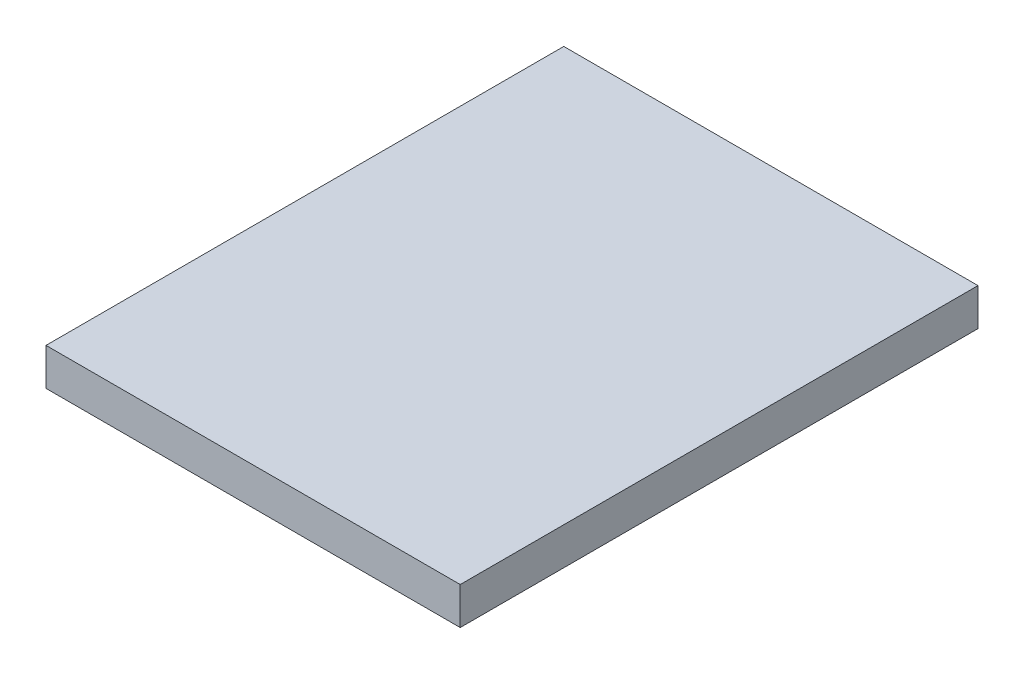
ISO-10303-21;
HEADER;
FILE_DESCRIPTION(('STEP AP214'),'2;1');
FILE_NAME('part.step','',(''),(''),'','','');
FILE_SCHEMA(('AUTOMOTIVE_DESIGN { 1 0 10303 214 1 1 1 1 }'));
ENDSEC;
DATA;
#1=APPLICATION_CONTEXT('core data for automotive mechanical design processes');
#2=APPLICATION_PROTOCOL_DEFINITION('international standard','automotive_design',2000,#1);
#3=PRODUCT_CONTEXT('',#1,'mechanical');
#4=PRODUCT('Part','Part','',(#3));
#5=PRODUCT_RELATED_PRODUCT_CATEGORY('part','',(#4));
#6=PRODUCT_DEFINITION_FORMATION('','',#4);
#7=PRODUCT_DEFINITION_CONTEXT('part definition',#1,'design');
#8=PRODUCT_DEFINITION('design','',#6,#7);
#9=PRODUCT_DEFINITION_SHAPE('','',#8);
#10=(LENGTH_UNIT() NAMED_UNIT(*) SI_UNIT(.MILLI.,.METRE.));
#11=(NAMED_UNIT(*) PLANE_ANGLE_UNIT() SI_UNIT($,.RADIAN.));
#12=(NAMED_UNIT(*) SI_UNIT($,.STERADIAN.) SOLID_ANGLE_UNIT());
#13=UNCERTAINTY_MEASURE_WITH_UNIT(LENGTH_MEASURE(1.E-05),#10,'distance_accuracy_value','');
#14=(GEOMETRIC_REPRESENTATION_CONTEXT(3) GLOBAL_UNCERTAINTY_ASSIGNED_CONTEXT((#13)) GLOBAL_UNIT_ASSIGNED_CONTEXT((#10,
#11,#12)) REPRESENTATION_CONTEXT('',''));
#15=CARTESIAN_POINT('',(0.,0.,0.));
#16=DIRECTION('',(0.,0.,1.));
#17=DIRECTION('',(1.,0.,0.));
#18=AXIS2_PLACEMENT_3D('',#15,#16,#17);
#19=CARTESIAN_POINT('',(100.,18.,125.));
#20=DIRECTION('',(-1.,0.,0.));
#21=DIRECTION('',(0.,0.,1.));
#22=AXIS2_PLACEMENT_3D('',#19,#20,#21);
#23=PLANE('',#22);
#24=DIRECTION('',(0.,0.,-1.));
#25=VECTOR('',#24,1.);
#26=CARTESIAN_POINT('',(100.,0.,125.));
#27=LINE('',#26,#25);
#28=CARTESIAN_POINT('',(100.,0.,125.));
#29=VERTEX_POINT('',#28);
#30=CARTESIAN_POINT('',(100.,0.,-125.));
#31=VERTEX_POINT('',#30);
#32=EDGE_CURVE('E102',#29,#31,#27,.T.);
#33=ORIENTED_EDGE('',*,*,#32,.T.);
#34=DIRECTION('',(0.,-1.,0.));
#35=VECTOR('',#34,1.);
#36=CARTESIAN_POINT('',(100.,18.,-125.));
#37=LINE('',#36,#35);
#38=CARTESIAN_POINT('',(100.,18.,-125.));
#39=VERTEX_POINT('',#38);
#40=EDGE_CURVE('E11',#39,#31,#37,.T.);
#41=ORIENTED_EDGE('',*,*,#40,.F.);
#42=DIRECTION('',(0.,0.,-1.));
#43=VECTOR('',#42,1.);
#44=CARTESIAN_POINT('',(100.,18.,125.));
#45=LINE('',#44,#43);
#46=CARTESIAN_POINT('',(100.,18.,125.));
#47=VERTEX_POINT('',#46);
#48=EDGE_CURVE('E90',#47,#39,#45,.T.);
#49=ORIENTED_EDGE('',*,*,#48,.F.);
#50=DIRECTION('',(0.,-1.,0.));
#51=VECTOR('',#50,1.);
#52=CARTESIAN_POINT('',(100.,18.,125.));
#53=LINE('',#52,#51);
#54=EDGE_CURVE('E98',#47,#29,#53,.T.);
#55=ORIENTED_EDGE('',*,*,#54,.T.);
#56=EDGE_LOOP('',(#33,#41,#49,#55));
#57=FACE_BOUND('',#56,.T.);
#58=ADVANCED_FACE('F39',(#57),#23,.F.);
#59=CARTESIAN_POINT('',(-100.,18.,-125.));
#60=DIRECTION('',(0.,0.,1.));
#61=DIRECTION('',(1.,0.,0.));
#62=AXIS2_PLACEMENT_3D('',#59,#60,#61);
#63=PLANE('',#62);
#64=DIRECTION('',(-1.,0.,0.));
#65=VECTOR('',#64,1.);
#66=CARTESIAN_POINT('',(-100.,0.,-125.));
#67=LINE('',#66,#65);
#68=CARTESIAN_POINT('',(-100.,0.,-125.));
#69=VERTEX_POINT('',#68);
#70=EDGE_CURVE('E94',#31,#69,#67,.T.);
#71=ORIENTED_EDGE('',*,*,#70,.T.);
#72=DIRECTION('',(0.,-1.,0.));
#73=VECTOR('',#72,1.);
#74=CARTESIAN_POINT('',(-100.,18.,-125.));
#75=LINE('',#74,#73);
#76=CARTESIAN_POINT('',(-100.,18.,-125.));
#77=VERTEX_POINT('',#76);
#78=EDGE_CURVE('E47',#77,#69,#75,.T.);
#79=ORIENTED_EDGE('',*,*,#78,.F.);
#80=DIRECTION('',(-1.,0.,0.));
#81=VECTOR('',#80,1.);
#82=CARTESIAN_POINT('',(-100.,18.,-125.));
#83=LINE('',#82,#81);
#84=EDGE_CURVE('E85',#39,#77,#83,.T.);
#85=ORIENTED_EDGE('',*,*,#84,.F.);
#86=ORIENTED_EDGE('',*,*,#40,.T.);
#87=EDGE_LOOP('',(#71,#79,#85,#86));
#88=FACE_BOUND('',#87,.T.);
#89=ADVANCED_FACE('F93',(#88),#63,.F.);
#90=CARTESIAN_POINT('',(-100.,18.,125.));
#91=DIRECTION('',(1.,0.,0.));
#92=DIRECTION('',(0.,0.,-1.));
#93=AXIS2_PLACEMENT_3D('',#90,#91,#92);
#94=PLANE('',#93);
#95=DIRECTION('',(0.,0.,1.));
#96=VECTOR('',#95,1.);
#97=CARTESIAN_POINT('',(-100.,0.,125.));
#98=LINE('',#97,#96);
#99=CARTESIAN_POINT('',(-100.,0.,125.));
#100=VERTEX_POINT('',#99);
#101=EDGE_CURVE('E72',#69,#100,#98,.T.);
#102=ORIENTED_EDGE('',*,*,#101,.T.);
#103=DIRECTION('',(0.,-1.,0.));
#104=VECTOR('',#103,1.);
#105=CARTESIAN_POINT('',(-100.,18.,125.));
#106=LINE('',#105,#104);
#107=CARTESIAN_POINT('',(-100.,18.,125.));
#108=VERTEX_POINT('',#107);
#109=EDGE_CURVE('E95',#108,#100,#106,.T.);
#110=ORIENTED_EDGE('',*,*,#109,.F.);
#111=DIRECTION('',(0.,0.,1.));
#112=VECTOR('',#111,1.);
#113=CARTESIAN_POINT('',(-100.,18.,125.));
#114=LINE('',#113,#112);
#115=EDGE_CURVE('E88',#77,#108,#114,.T.);
#116=ORIENTED_EDGE('',*,*,#115,.F.);
#117=ORIENTED_EDGE('',*,*,#78,.T.);
#118=EDGE_LOOP('',(#102,#110,#116,#117));
#119=FACE_BOUND('',#118,.T.);
#120=ADVANCED_FACE('F96',(#119),#94,.F.);
#121=CARTESIAN_POINT('',(-100.,18.,125.));
#122=DIRECTION('',(0.,0.,-1.));
#123=DIRECTION('',(-1.,0.,0.));
#124=AXIS2_PLACEMENT_3D('',#121,#122,#123);
#125=PLANE('',#124);
#126=DIRECTION('',(1.,0.,0.));
#127=VECTOR('',#126,1.);
#128=CARTESIAN_POINT('',(-100.,0.,125.));
#129=LINE('',#128,#127);
#130=EDGE_CURVE('E78',#100,#29,#129,.T.);
#131=ORIENTED_EDGE('',*,*,#130,.T.);
#132=ORIENTED_EDGE('',*,*,#54,.F.);
#133=DIRECTION('',(1.,0.,0.));
#134=VECTOR('',#133,1.);
#135=CARTESIAN_POINT('',(-100.,18.,125.));
#136=LINE('',#135,#134);
#137=EDGE_CURVE('E55',#108,#47,#136,.T.);
#138=ORIENTED_EDGE('',*,*,#137,.F.);
#139=ORIENTED_EDGE('',*,*,#109,.T.);
#140=EDGE_LOOP('',(#131,#132,#138,#139));
#141=FACE_BOUND('',#140,.T.);
#142=ADVANCED_FACE('F110',(#141),#125,.F.);
#143=CARTESIAN_POINT('',(0.,18.,0.));
#144=DIRECTION('',(0.,-1.,0.));
#145=DIRECTION('',(0.,0.,-1.));
#146=AXIS2_PLACEMENT_3D('',#143,#144,#145);
#147=PLANE('',#146);
#148=ORIENTED_EDGE('',*,*,#48,.T.);
#149=ORIENTED_EDGE('',*,*,#84,.T.);
#150=ORIENTED_EDGE('',*,*,#115,.T.);
#151=ORIENTED_EDGE('',*,*,#137,.T.);
#152=EDGE_LOOP('',(#148,#149,#150,#151));
#153=FACE_BOUND('',#152,.T.);
#154=ADVANCED_FACE('F86',(#153),#147,.F.);
#155=CARTESIAN_POINT('',(0.,0.,0.));
#156=DIRECTION('',(0.,-1.,0.));
#157=DIRECTION('',(0.,0.,-1.));
#158=AXIS2_PLACEMENT_3D('',#155,#156,#157);
#159=PLANE('',#158);
#160=CARTESIAN_POINT('',(4.65874281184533,0.,67.6133351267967));
#161=DIRECTION('',(0.,-1.,0.));
#162=DIRECTION('',(0.,0.,-1.));
#163=AXIS2_PLACEMENT_3D('',#160,#161,#162);
#164=CIRCLE('',#163,5.00000000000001);
#165=CARTESIAN_POINT('',(4.65874281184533,0.,62.6133351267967));
#166=VERTEX_POINT('',#165);
#167=EDGE_CURVE('E148',#166,#166,#164,.T.);
#168=ORIENTED_EDGE('',*,*,#167,.F.);
#169=EDGE_LOOP('',(#168));
#170=FACE_BOUND('',#169,.T.);
#171=CARTESIAN_POINT('',(-17.3866648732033,0.,89.6587428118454));
#172=DIRECTION('',(0.,-1.,0.));
#173=DIRECTION('',(0.,0.,-1.));
#174=AXIS2_PLACEMENT_3D('',#171,#172,#173);
#175=CIRCLE('',#174,5.00000000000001);
#176=CARTESIAN_POINT('',(-17.3866648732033,0.,84.6587428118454));
#177=VERTEX_POINT('',#176);
#178=EDGE_CURVE('E136',#177,#177,#175,.T.);
#179=ORIENTED_EDGE('',*,*,#178,.F.);
#180=EDGE_LOOP('',(#179));
#181=FACE_BOUND('',#180,.T.);
#182=CARTESIAN_POINT('',(12.7279220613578,0.,97.7279220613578));
#183=DIRECTION('',(0.,-1.,0.));
#184=DIRECTION('',(0.,0.,-1.));
#185=AXIS2_PLACEMENT_3D('',#182,#183,#184);
#186=CIRCLE('',#185,5.00000000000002);
#187=CARTESIAN_POINT('',(12.7279220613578,0.,92.7279220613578));
#188=VERTEX_POINT('',#187);
#189=EDGE_CURVE('E124',#188,#188,#186,.T.);
#190=ORIENTED_EDGE('',*,*,#189,.F.);
#191=EDGE_LOOP('',(#190));
#192=FACE_BOUND('',#191,.T.);
#193=ORIENTED_EDGE('',*,*,#32,.F.);
#194=ORIENTED_EDGE('',*,*,#130,.F.);
#195=ORIENTED_EDGE('',*,*,#101,.F.);
#196=ORIENTED_EDGE('',*,*,#70,.F.);
#197=EDGE_LOOP('',(#193,#194,#195,#196));
#198=FACE_BOUND('',#197,.T.);
#199=ADVANCED_FACE('F113',(#170,#181,#192,#198),#159,.T.);
#200=CARTESIAN_POINT('',(12.7279220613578,9.99999999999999,97.7279220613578));
#201=DIRECTION('',(0.,1.,0.));
#202=DIRECTION('',(0.,0.,1.));
#203=AXIS2_PLACEMENT_3D('',#200,#201,#202);
#204=PLANE('',#203);
#205=CARTESIAN_POINT('',(12.7279220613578,9.99999999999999,97.7279220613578));
#206=DIRECTION('',(0.,-1.,0.));
#207=DIRECTION('',(0.,0.,-1.));
#208=AXIS2_PLACEMENT_3D('',#205,#206,#207);
#209=CIRCLE('',#208,1.00000000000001);
#210=CARTESIAN_POINT('',(12.7279220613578,9.99999999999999,96.7279220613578));
#211=VERTEX_POINT('',#210);
#212=EDGE_CURVE('E105',#211,#211,#209,.T.);
#213=ORIENTED_EDGE('',*,*,#212,.T.);
#214=EDGE_LOOP('',(#213));
#215=FACE_BOUND('',#214,.T.);
#216=ADVANCED_FACE('F156',(#215),#204,.F.);
#217=CARTESIAN_POINT('',(12.7279220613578,0.,97.7279220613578));
#218=DIRECTION('',(0.,-1.,0.));
#219=DIRECTION('',(0.,0.,-1.));
#220=AXIS2_PLACEMENT_3D('',#217,#218,#219);
#221=CYLINDRICAL_SURFACE('',#220,1.00000000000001);
#222=ORIENTED_EDGE('',*,*,#212,.F.);
#223=EDGE_LOOP('',(#222));
#224=FACE_BOUND('',#223,.T.);
#225=CARTESIAN_POINT('',(12.7279220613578,4.,97.7279220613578));
#226=DIRECTION('',(0.,-1.,0.));
#227=DIRECTION('',(0.,0.,-1.));
#228=AXIS2_PLACEMENT_3D('',#225,#226,#227);
#229=CIRCLE('',#228,1.00000000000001);
#230=CARTESIAN_POINT('',(12.7279220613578,4.,96.7279220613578));
#231=VERTEX_POINT('',#230);
#232=EDGE_CURVE('E118',#231,#231,#229,.T.);
#233=ORIENTED_EDGE('',*,*,#232,.T.);
#234=EDGE_LOOP('',(#233));
#235=FACE_BOUND('',#234,.T.);
#236=ADVANCED_FACE('F175',(#224,#235),#221,.F.);
#237=CARTESIAN_POINT('',(13.7279220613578,4.,97.7279220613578));
#238=DIRECTION('',(0.,1.,0.));
#239=DIRECTION('',(0.,0.,1.));
#240=AXIS2_PLACEMENT_3D('',#237,#238,#239);
#241=PLANE('',#240);
#242=ORIENTED_EDGE('',*,*,#232,.F.);
#243=EDGE_LOOP('',(#242));
#244=FACE_BOUND('',#243,.T.);
#245=CARTESIAN_POINT('',(12.7279220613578,4.,97.7279220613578));
#246=DIRECTION('',(0.,-1.,0.));
#247=DIRECTION('',(0.,0.,-1.));
#248=AXIS2_PLACEMENT_3D('',#245,#246,#247);
#249=CIRCLE('',#248,5.00000000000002);
#250=CARTESIAN_POINT('',(12.7279220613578,4.,92.7279220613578));
#251=VERTEX_POINT('',#250);
#252=EDGE_CURVE('E121',#251,#251,#249,.T.);
#253=ORIENTED_EDGE('',*,*,#252,.T.);
#254=EDGE_LOOP('',(#253));
#255=FACE_BOUND('',#254,.T.);
#256=ADVANCED_FACE('F165',(#244,#255),#241,.F.);
#257=CARTESIAN_POINT('',(12.7279220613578,0.,97.7279220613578));
#258=DIRECTION('',(0.,-1.,0.));
#259=DIRECTION('',(0.,0.,-1.));
#260=AXIS2_PLACEMENT_3D('',#257,#258,#259);
#261=CYLINDRICAL_SURFACE('',#260,5.00000000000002);
#262=ORIENTED_EDGE('',*,*,#252,.F.);
#263=EDGE_LOOP('',(#262));
#264=FACE_BOUND('',#263,.T.);
#265=ORIENTED_EDGE('',*,*,#189,.T.);
#266=EDGE_LOOP('',(#265));
#267=FACE_BOUND('',#266,.T.);
#268=ADVANCED_FACE('F162',(#264,#267),#261,.F.);
#269=CARTESIAN_POINT('',(-17.3866648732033,9.99999999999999,89.6587428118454));
#270=DIRECTION('',(0.,1.,0.));
#271=DIRECTION('',(0.,0.,1.));
#272=AXIS2_PLACEMENT_3D('',#269,#270,#271);
#273=PLANE('',#272);
#274=CARTESIAN_POINT('',(-17.3866648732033,9.99999999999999,89.6587428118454));
#275=DIRECTION('',(0.,-1.,0.));
#276=DIRECTION('',(0.,0.,-1.));
#277=AXIS2_PLACEMENT_3D('',#274,#275,#276);
#278=CIRCLE('',#277,1.00000000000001);
#279=CARTESIAN_POINT('',(-17.3866648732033,9.99999999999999,88.6587428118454));
#280=VERTEX_POINT('',#279);
#281=EDGE_CURVE('E127',#280,#280,#278,.T.);
#282=ORIENTED_EDGE('',*,*,#281,.T.);
#283=EDGE_LOOP('',(#282));
#284=FACE_BOUND('',#283,.T.);
#285=ADVANCED_FACE('F164',(#284),#273,.F.);
#286=CARTESIAN_POINT('',(-17.3866648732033,0.,89.6587428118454));
#287=DIRECTION('',(0.,-1.,0.));
#288=DIRECTION('',(0.,0.,-1.));
#289=AXIS2_PLACEMENT_3D('',#286,#287,#288);
#290=CYLINDRICAL_SURFACE('',#289,1.00000000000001);
#291=ORIENTED_EDGE('',*,*,#281,.F.);
#292=EDGE_LOOP('',(#291));
#293=FACE_BOUND('',#292,.T.);
#294=CARTESIAN_POINT('',(-17.3866648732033,4.,89.6587428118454));
#295=DIRECTION('',(0.,-1.,0.));
#296=DIRECTION('',(0.,0.,-1.));
#297=AXIS2_PLACEMENT_3D('',#294,#295,#296);
#298=CIRCLE('',#297,1.00000000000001);
#299=CARTESIAN_POINT('',(-17.3866648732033,4.,88.6587428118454));
#300=VERTEX_POINT('',#299);
#301=EDGE_CURVE('E130',#300,#300,#298,.T.);
#302=ORIENTED_EDGE('',*,*,#301,.T.);
#303=EDGE_LOOP('',(#302));
#304=FACE_BOUND('',#303,.T.);
#305=ADVANCED_FACE('F172',(#293,#304),#290,.F.);
#306=CARTESIAN_POINT('',(-16.3866648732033,4.,89.6587428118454));
#307=DIRECTION('',(0.,1.,0.));
#308=DIRECTION('',(0.,0.,1.));
#309=AXIS2_PLACEMENT_3D('',#306,#307,#308);
#310=PLANE('',#309);
#311=ORIENTED_EDGE('',*,*,#301,.F.);
#312=EDGE_LOOP('',(#311));
#313=FACE_BOUND('',#312,.T.);
#314=CARTESIAN_POINT('',(-17.3866648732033,4.,89.6587428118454));
#315=DIRECTION('',(0.,-1.,0.));
#316=DIRECTION('',(0.,0.,-1.));
#317=AXIS2_PLACEMENT_3D('',#314,#315,#316);
#318=CIRCLE('',#317,5.00000000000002);
#319=CARTESIAN_POINT('',(-17.3866648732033,4.,84.6587428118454));
#320=VERTEX_POINT('',#319);
#321=EDGE_CURVE('E133',#320,#320,#318,.T.);
#322=ORIENTED_EDGE('',*,*,#321,.T.);
#323=EDGE_LOOP('',(#322));
#324=FACE_BOUND('',#323,.T.);
#325=ADVANCED_FACE('F228',(#313,#324),#310,.F.);
#326=CARTESIAN_POINT('',(-17.3866648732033,0.,89.6587428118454));
#327=DIRECTION('',(0.,-1.,0.));
#328=DIRECTION('',(0.,0.,-1.));
#329=AXIS2_PLACEMENT_3D('',#326,#327,#328);
#330=CYLINDRICAL_SURFACE('',#329,5.00000000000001);
#331=ORIENTED_EDGE('',*,*,#321,.F.);
#332=EDGE_LOOP('',(#331));
#333=FACE_BOUND('',#332,.T.);
#334=ORIENTED_EDGE('',*,*,#178,.T.);
#335=EDGE_LOOP('',(#334));
#336=FACE_BOUND('',#335,.T.);
#337=ADVANCED_FACE('F238',(#333,#336),#330,.F.);
#338=CARTESIAN_POINT('',(4.65874281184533,9.99999999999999,67.6133351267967));
#339=DIRECTION('',(0.,1.,0.));
#340=DIRECTION('',(0.,0.,1.));
#341=AXIS2_PLACEMENT_3D('',#338,#339,#340);
#342=PLANE('',#341);
#343=CARTESIAN_POINT('',(4.65874281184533,9.99999999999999,67.6133351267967));
#344=DIRECTION('',(0.,-1.,0.));
#345=DIRECTION('',(0.,0.,-1.));
#346=AXIS2_PLACEMENT_3D('',#343,#344,#345);
#347=CIRCLE('',#346,1.00000000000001);
#348=CARTESIAN_POINT('',(4.65874281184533,9.99999999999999,66.6133351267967));
#349=VERTEX_POINT('',#348);
#350=EDGE_CURVE('E139',#349,#349,#347,.T.);
#351=ORIENTED_EDGE('',*,*,#350,.T.);
#352=EDGE_LOOP('',(#351));
#353=FACE_BOUND('',#352,.T.);
#354=ADVANCED_FACE('F248',(#353),#342,.F.);
#355=CARTESIAN_POINT('',(4.65874281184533,0.,67.6133351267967));
#356=DIRECTION('',(0.,-1.,0.));
#357=DIRECTION('',(0.,0.,-1.));
#358=AXIS2_PLACEMENT_3D('',#355,#356,#357);
#359=CYLINDRICAL_SURFACE('',#358,1.00000000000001);
#360=ORIENTED_EDGE('',*,*,#350,.F.);
#361=EDGE_LOOP('',(#360));
#362=FACE_BOUND('',#361,.T.);
#363=CARTESIAN_POINT('',(4.65874281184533,4.,67.6133351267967));
#364=DIRECTION('',(0.,-1.,0.));
#365=DIRECTION('',(0.,0.,-1.));
#366=AXIS2_PLACEMENT_3D('',#363,#364,#365);
#367=CIRCLE('',#366,1.00000000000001);
#368=CARTESIAN_POINT('',(4.65874281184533,4.,66.6133351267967));
#369=VERTEX_POINT('',#368);
#370=EDGE_CURVE('E142',#369,#369,#367,.T.);
#371=ORIENTED_EDGE('',*,*,#370,.T.);
#372=EDGE_LOOP('',(#371));
#373=FACE_BOUND('',#372,.T.);
#374=ADVANCED_FACE('F258',(#362,#373),#359,.F.);
#375=CARTESIAN_POINT('',(5.65874281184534,4.,67.6133351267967));
#376=DIRECTION('',(0.,1.,0.));
#377=DIRECTION('',(0.,0.,1.));
#378=AXIS2_PLACEMENT_3D('',#375,#376,#377);
#379=PLANE('',#378);
#380=ORIENTED_EDGE('',*,*,#370,.F.);
#381=EDGE_LOOP('',(#380));
#382=FACE_BOUND('',#381,.T.);
#383=CARTESIAN_POINT('',(4.65874281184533,4.,67.6133351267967));
#384=DIRECTION('',(0.,-1.,0.));
#385=DIRECTION('',(0.,0.,-1.));
#386=AXIS2_PLACEMENT_3D('',#383,#384,#385);
#387=CIRCLE('',#386,5.00000000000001);
#388=CARTESIAN_POINT('',(4.65874281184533,4.,62.6133351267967));
#389=VERTEX_POINT('',#388);
#390=EDGE_CURVE('E145',#389,#389,#387,.T.);
#391=ORIENTED_EDGE('',*,*,#390,.T.);
#392=EDGE_LOOP('',(#391));
#393=FACE_BOUND('',#392,.T.);
#394=ADVANCED_FACE('F268',(#382,#393),#379,.F.);
#395=CARTESIAN_POINT('',(4.65874281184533,0.,67.6133351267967));
#396=DIRECTION('',(0.,-1.,0.));
#397=DIRECTION('',(0.,0.,-1.));
#398=AXIS2_PLACEMENT_3D('',#395,#396,#397);
#399=CYLINDRICAL_SURFACE('',#398,5.00000000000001);
#400=ORIENTED_EDGE('',*,*,#390,.F.);
#401=EDGE_LOOP('',(#400));
#402=FACE_BOUND('',#401,.T.);
#403=ORIENTED_EDGE('',*,*,#167,.T.);
#404=EDGE_LOOP('',(#403));
#405=FACE_BOUND('',#404,.T.);
#406=ADVANCED_FACE('F152',(#402,#405),#399,.F.);
#407=CLOSED_SHELL('',(#58,#89,#120,#142,#154,#199,#216,#236,#256,#268,#285,#305,#325,#337,#354,
#374,#394,#406));
#408=MANIFOLD_SOLID_BREP('B2',#407);
#409=ADVANCED_BREP_SHAPE_REPRESENTATION('',(#18,#408),#14);
#410=SHAPE_DEFINITION_REPRESENTATION(#9,#409);
ENDSEC;
END-ISO-10303-21;
